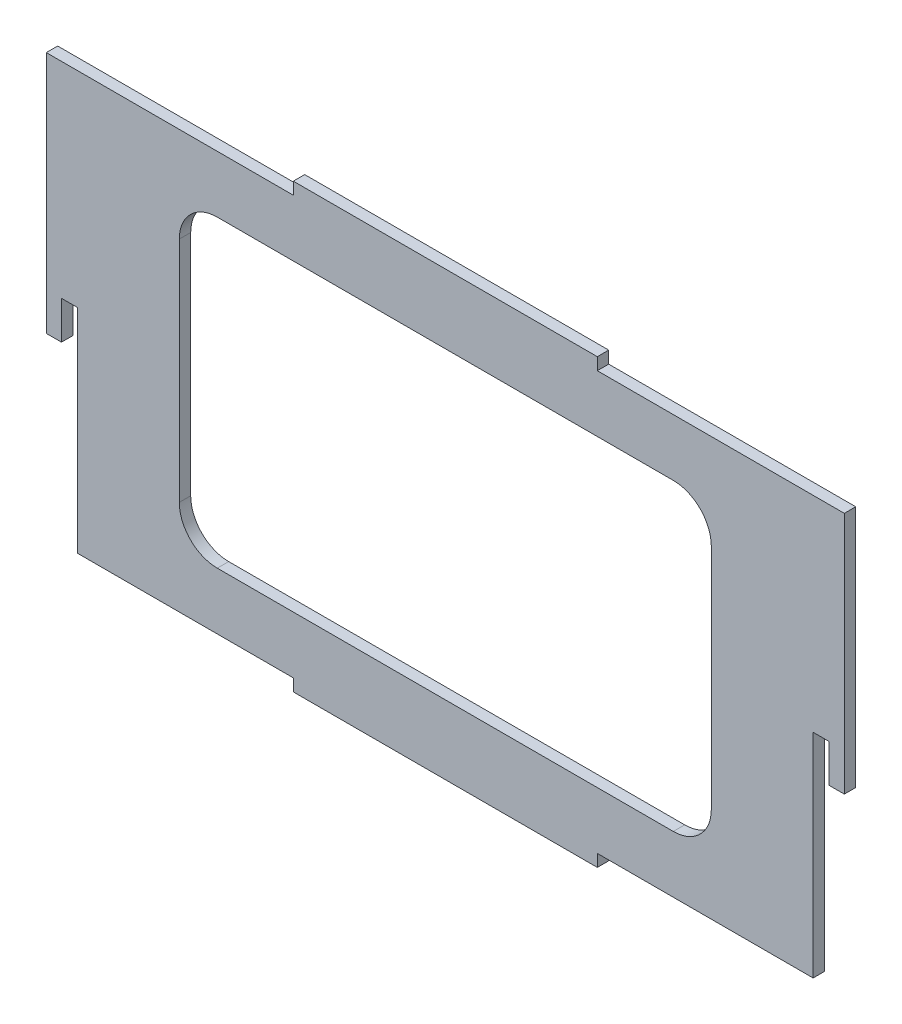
ISO-10303-21;
HEADER;
FILE_DESCRIPTION(('STEP AP214'),'2;1');
FILE_NAME('part.step','',(''),(''),'','','');
FILE_SCHEMA(('AUTOMOTIVE_DESIGN { 1 0 10303 214 1 1 1 1 }'));
ENDSEC;
DATA;
#1=APPLICATION_CONTEXT('core data for automotive mechanical design processes');
#2=APPLICATION_PROTOCOL_DEFINITION('international standard','automotive_design',2000,#1);
#3=PRODUCT_CONTEXT('',#1,'mechanical');
#4=PRODUCT('Part','Part','',(#3));
#5=PRODUCT_RELATED_PRODUCT_CATEGORY('part','',(#4));
#6=PRODUCT_DEFINITION_FORMATION('','',#4);
#7=PRODUCT_DEFINITION_CONTEXT('part definition',#1,'design');
#8=PRODUCT_DEFINITION('design','',#6,#7);
#9=PRODUCT_DEFINITION_SHAPE('','',#8);
#10=(LENGTH_UNIT() NAMED_UNIT(*) SI_UNIT(.MILLI.,.METRE.));
#11=(NAMED_UNIT(*) PLANE_ANGLE_UNIT() SI_UNIT($,.RADIAN.));
#12=(NAMED_UNIT(*) SI_UNIT($,.STERADIAN.) SOLID_ANGLE_UNIT());
#13=UNCERTAINTY_MEASURE_WITH_UNIT(LENGTH_MEASURE(1.E-05),#10,'distance_accuracy_value','');
#14=(GEOMETRIC_REPRESENTATION_CONTEXT(3) GLOBAL_UNCERTAINTY_ASSIGNED_CONTEXT((#13)) GLOBAL_UNIT_ASSIGNED_CONTEXT((#10,
#11,#12)) REPRESENTATION_CONTEXT('',''));
#15=CARTESIAN_POINT('',(0.,0.,0.));
#16=DIRECTION('',(0.,0.,1.));
#17=DIRECTION('',(1.,0.,0.));
#18=AXIS2_PLACEMENT_3D('',#15,#16,#17);
#19=CARTESIAN_POINT('',(0.,0.,1.5));
#20=DIRECTION('',(0.,0.,1.));
#21=DIRECTION('',(1.,0.,0.));
#22=AXIS2_PLACEMENT_3D('',#19,#20,#21);
#23=PLANE('',#22);
#24=DIRECTION('',(1.,0.,0.));
#25=VECTOR('',#24,1.);
#26=CARTESIAN_POINT('',(-30.,-20.,1.5));
#27=LINE('',#26,#25);
#28=CARTESIAN_POINT('',(-30.,-20.,1.5));
#29=VERTEX_POINT('',#28);
#30=CARTESIAN_POINT('',(30.,-20.,1.5));
#31=VERTEX_POINT('',#30);
#32=EDGE_CURVE('E464',#29,#31,#27,.T.);
#33=ORIENTED_EDGE('',*,*,#32,.F.);
#34=CARTESIAN_POINT('',(-30.,-15.,1.5));
#35=DIRECTION('',(0.,0.,1.));
#36=DIRECTION('',(1.,0.,0.));
#37=AXIS2_PLACEMENT_3D('',#34,#35,#36);
#38=CIRCLE('',#37,5.);
#39=CARTESIAN_POINT('',(-35.,-15.,1.5));
#40=VERTEX_POINT('',#39);
#41=EDGE_CURVE('E461',#40,#29,#38,.T.);
#42=ORIENTED_EDGE('',*,*,#41,.F.);
#43=DIRECTION('',(0.,-1.,0.));
#44=VECTOR('',#43,1.);
#45=CARTESIAN_POINT('',(-35.,15.,1.5));
#46=LINE('',#45,#44);
#47=CARTESIAN_POINT('',(-35.,15.,1.5));
#48=VERTEX_POINT('',#47);
#49=EDGE_CURVE('E484',#48,#40,#46,.T.);
#50=ORIENTED_EDGE('',*,*,#49,.F.);
#51=CARTESIAN_POINT('',(-30.,15.,1.5));
#52=DIRECTION('',(0.,0.,1.));
#53=DIRECTION('',(1.,0.,0.));
#54=AXIS2_PLACEMENT_3D('',#51,#52,#53);
#55=CIRCLE('',#54,5.);
#56=CARTESIAN_POINT('',(-30.,20.,1.5));
#57=VERTEX_POINT('',#56);
#58=EDGE_CURVE('E480',#57,#48,#55,.T.);
#59=ORIENTED_EDGE('',*,*,#58,.F.);
#60=DIRECTION('',(-1.,0.,0.));
#61=VECTOR('',#60,1.);
#62=CARTESIAN_POINT('',(-30.,20.,1.5));
#63=LINE('',#62,#61);
#64=CARTESIAN_POINT('',(30.,20.,1.5));
#65=VERTEX_POINT('',#64);
#66=EDGE_CURVE('E477',#65,#57,#63,.T.);
#67=ORIENTED_EDGE('',*,*,#66,.F.);
#68=CARTESIAN_POINT('',(30.,15.,1.5));
#69=DIRECTION('',(0.,0.,1.));
#70=DIRECTION('',(-1.,0.,0.));
#71=AXIS2_PLACEMENT_3D('',#68,#69,#70);
#72=CIRCLE('',#71,5.);
#73=CARTESIAN_POINT('',(35.,15.,1.5));
#74=VERTEX_POINT('',#73);
#75=EDGE_CURVE('E474',#74,#65,#72,.T.);
#76=ORIENTED_EDGE('',*,*,#75,.F.);
#77=DIRECTION('',(0.,1.,0.));
#78=VECTOR('',#77,1.);
#79=CARTESIAN_POINT('',(35.,15.,1.5));
#80=LINE('',#79,#78);
#81=CARTESIAN_POINT('',(35.,-15.,1.5));
#82=VERTEX_POINT('',#81);
#83=EDGE_CURVE('E471',#82,#74,#80,.T.);
#84=ORIENTED_EDGE('',*,*,#83,.F.);
#85=CARTESIAN_POINT('',(30.,-15.,1.5));
#86=DIRECTION('',(0.,0.,1.));
#87=DIRECTION('',(1.,0.,0.));
#88=AXIS2_PLACEMENT_3D('',#85,#86,#87);
#89=CIRCLE('',#88,5.);
#90=EDGE_CURVE('E468',#31,#82,#89,.T.);
#91=ORIENTED_EDGE('',*,*,#90,.F.);
#92=EDGE_LOOP('',(#33,#42,#50,#59,#67,#76,#84,#91));
#93=FACE_BOUND('',#92,.T.);
#94=DIRECTION('',(0.,-1.,0.));
#95=VECTOR('',#94,1.);
#96=CARTESIAN_POINT('',(-52.5,27.5,1.5));
#97=LINE('',#96,#95);
#98=CARTESIAN_POINT('',(-52.5,27.5,1.5));
#99=VERTEX_POINT('',#98);
#100=CARTESIAN_POINT('',(-52.5,-4.5,1.5));
#101=VERTEX_POINT('',#100);
#102=EDGE_CURVE('E409',#99,#101,#97,.T.);
#103=ORIENTED_EDGE('',*,*,#102,.T.);
#104=DIRECTION('',(1.,0.,0.));
#105=VECTOR('',#104,1.);
#106=CARTESIAN_POINT('',(0.,-4.5,1.5));
#107=LINE('',#106,#105);
#108=CARTESIAN_POINT('',(-50.5,-4.5,1.5));
#109=VERTEX_POINT('',#108);
#110=EDGE_CURVE('E224',#101,#109,#107,.T.);
#111=ORIENTED_EDGE('',*,*,#110,.T.);
#112=DIRECTION('',(0.,1.,0.));
#113=VECTOR('',#112,1.);
#114=CARTESIAN_POINT('',(-50.5,-27.5,1.5));
#115=LINE('',#114,#113);
#116=CARTESIAN_POINT('',(-50.5,0.499999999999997,1.5));
#117=VERTEX_POINT('',#116);
#118=EDGE_CURVE('E412',#109,#117,#115,.T.);
#119=ORIENTED_EDGE('',*,*,#118,.T.);
#120=DIRECTION('',(1.,0.,0.));
#121=VECTOR('',#120,1.);
#122=CARTESIAN_POINT('',(-50.5,0.499999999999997,1.5));
#123=LINE('',#122,#121);
#124=CARTESIAN_POINT('',(-48.4,0.499999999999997,1.5));
#125=VERTEX_POINT('',#124);
#126=EDGE_CURVE('E419',#117,#125,#123,.T.);
#127=ORIENTED_EDGE('',*,*,#126,.T.);
#128=DIRECTION('',(0.,-1.,0.));
#129=VECTOR('',#128,1.);
#130=CARTESIAN_POINT('',(-48.4,-27.5,1.5));
#131=LINE('',#130,#129);
#132=CARTESIAN_POINT('',(-48.4,-27.5,1.5));
#133=VERTEX_POINT('',#132);
#134=EDGE_CURVE('E422',#125,#133,#131,.T.);
#135=ORIENTED_EDGE('',*,*,#134,.T.);
#136=DIRECTION('',(1.,0.,0.));
#137=VECTOR('',#136,1.);
#138=CARTESIAN_POINT('',(-48.4,-27.5,1.5));
#139=LINE('',#138,#137);
#140=CARTESIAN_POINT('',(-20.,-27.5,1.5));
#141=VERTEX_POINT('',#140);
#142=EDGE_CURVE('E425',#133,#141,#139,.T.);
#143=ORIENTED_EDGE('',*,*,#142,.T.);
#144=DIRECTION('',(0.,-1.,0.));
#145=VECTOR('',#144,1.);
#146=CARTESIAN_POINT('',(-20.,-27.5,1.5));
#147=LINE('',#146,#145);
#148=CARTESIAN_POINT('',(-20.,-29.1,1.5));
#149=VERTEX_POINT('',#148);
#150=EDGE_CURVE('E428',#141,#149,#147,.T.);
#151=ORIENTED_EDGE('',*,*,#150,.T.);
#152=DIRECTION('',(1.,0.,0.));
#153=VECTOR('',#152,1.);
#154=CARTESIAN_POINT('',(-20.,-29.1,1.5));
#155=LINE('',#154,#153);
#156=CARTESIAN_POINT('',(20.,-29.1,1.5));
#157=VERTEX_POINT('',#156);
#158=EDGE_CURVE('E431',#149,#157,#155,.T.);
#159=ORIENTED_EDGE('',*,*,#158,.T.);
#160=DIRECTION('',(0.,1.,0.));
#161=VECTOR('',#160,1.);
#162=CARTESIAN_POINT('',(20.,-27.5,1.5));
#163=LINE('',#162,#161);
#164=CARTESIAN_POINT('',(20.,-27.5,1.5));
#165=VERTEX_POINT('',#164);
#166=EDGE_CURVE('E434',#157,#165,#163,.T.);
#167=ORIENTED_EDGE('',*,*,#166,.T.);
#168=DIRECTION('',(1.,0.,0.));
#169=VECTOR('',#168,1.);
#170=CARTESIAN_POINT('',(20.,-27.5,1.5));
#171=LINE('',#170,#169);
#172=CARTESIAN_POINT('',(48.4,-27.5,1.5));
#173=VERTEX_POINT('',#172);
#174=EDGE_CURVE('E437',#165,#173,#171,.T.);
#175=ORIENTED_EDGE('',*,*,#174,.T.);
#176=DIRECTION('',(0.,1.,0.));
#177=VECTOR('',#176,1.);
#178=CARTESIAN_POINT('',(48.4,-27.5,1.5));
#179=LINE('',#178,#177);
#180=CARTESIAN_POINT('',(48.4,0.499999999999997,1.5));
#181=VERTEX_POINT('',#180);
#182=EDGE_CURVE('E440',#173,#181,#179,.T.);
#183=ORIENTED_EDGE('',*,*,#182,.T.);
#184=DIRECTION('',(1.,0.,0.));
#185=VECTOR('',#184,1.);
#186=CARTESIAN_POINT('',(50.5,0.499999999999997,1.5));
#187=LINE('',#186,#185);
#188=CARTESIAN_POINT('',(50.5,0.499999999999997,1.5));
#189=VERTEX_POINT('',#188);
#190=EDGE_CURVE('E389',#181,#189,#187,.T.);
#191=ORIENTED_EDGE('',*,*,#190,.T.);
#192=DIRECTION('',(0.,-1.,0.));
#193=VECTOR('',#192,1.);
#194=CARTESIAN_POINT('',(50.5,-27.5,1.5));
#195=LINE('',#194,#193);
#196=CARTESIAN_POINT('',(50.5,-4.5,1.5));
#197=VERTEX_POINT('',#196);
#198=EDGE_CURVE('E377',#189,#197,#195,.T.);
#199=ORIENTED_EDGE('',*,*,#198,.T.);
#200=DIRECTION('',(1.,0.,0.));
#201=VECTOR('',#200,1.);
#202=CARTESIAN_POINT('',(0.,-4.5,1.5));
#203=LINE('',#202,#201);
#204=CARTESIAN_POINT('',(52.5,-4.5,1.5));
#205=VERTEX_POINT('',#204);
#206=EDGE_CURVE('E229',#197,#205,#203,.T.);
#207=ORIENTED_EDGE('',*,*,#206,.T.);
#208=DIRECTION('',(0.,1.,0.));
#209=VECTOR('',#208,1.);
#210=CARTESIAN_POINT('',(52.5,27.5,1.5));
#211=LINE('',#210,#209);
#212=CARTESIAN_POINT('',(52.5,27.5,1.5));
#213=VERTEX_POINT('',#212);
#214=EDGE_CURVE('E374',#205,#213,#211,.T.);
#215=ORIENTED_EDGE('',*,*,#214,.T.);
#216=DIRECTION('',(-1.,0.,0.));
#217=VECTOR('',#216,1.);
#218=CARTESIAN_POINT('',(20.,27.5,1.5));
#219=LINE('',#218,#217);
#220=CARTESIAN_POINT('',(20.,27.5,1.5));
#221=VERTEX_POINT('',#220);
#222=EDGE_CURVE('E383',#213,#221,#219,.T.);
#223=ORIENTED_EDGE('',*,*,#222,.T.);
#224=DIRECTION('',(0.,1.,0.));
#225=VECTOR('',#224,1.);
#226=CARTESIAN_POINT('',(20.,27.5,1.5));
#227=LINE('',#226,#225);
#228=CARTESIAN_POINT('',(20.,29.1,1.5));
#229=VERTEX_POINT('',#228);
#230=EDGE_CURVE('E387',#221,#229,#227,.T.);
#231=ORIENTED_EDGE('',*,*,#230,.T.);
#232=DIRECTION('',(-1.,0.,0.));
#233=VECTOR('',#232,1.);
#234=CARTESIAN_POINT('',(-20.,29.1,1.5));
#235=LINE('',#234,#233);
#236=CARTESIAN_POINT('',(-20.,29.1,1.5));
#237=VERTEX_POINT('',#236);
#238=EDGE_CURVE('E395',#229,#237,#235,.T.);
#239=ORIENTED_EDGE('',*,*,#238,.T.);
#240=DIRECTION('',(0.,-1.,0.));
#241=VECTOR('',#240,1.);
#242=CARTESIAN_POINT('',(-20.,27.5,1.5));
#243=LINE('',#242,#241);
#244=CARTESIAN_POINT('',(-20.,27.5,1.5));
#245=VERTEX_POINT('',#244);
#246=EDGE_CURVE('E308',#237,#245,#243,.T.);
#247=ORIENTED_EDGE('',*,*,#246,.T.);
#248=DIRECTION('',(-1.,0.,0.));
#249=VECTOR('',#248,1.);
#250=CARTESIAN_POINT('',(-52.5,27.5,1.5));
#251=LINE('',#250,#249);
#252=EDGE_CURVE('E302',#245,#99,#251,.T.);
#253=ORIENTED_EDGE('',*,*,#252,.T.);
#254=EDGE_LOOP('',(#103,#111,#119,#127,#135,#143,#151,#159,#167,#175,#183,#191,#199,#207,#215,
#223,#231,#239,#247,#253));
#255=FACE_BOUND('',#254,.T.);
#256=ADVANCED_FACE('F38',(#93,#255),#23,.T.);
#257=CARTESIAN_POINT('',(0.,0.,0.));
#258=DIRECTION('',(0.,0.,1.));
#259=DIRECTION('',(1.,0.,0.));
#260=AXIS2_PLACEMENT_3D('',#257,#258,#259);
#261=PLANE('',#260);
#262=CARTESIAN_POINT('',(-30.,-15.,0.));
#263=DIRECTION('',(0.,0.,1.));
#264=DIRECTION('',(1.,0.,0.));
#265=AXIS2_PLACEMENT_3D('',#262,#263,#264);
#266=CIRCLE('',#265,5.);
#267=CARTESIAN_POINT('',(-35.,-15.,0.));
#268=VERTEX_POINT('',#267);
#269=CARTESIAN_POINT('',(-30.,-20.,0.));
#270=VERTEX_POINT('',#269);
#271=EDGE_CURVE('E460',#268,#270,#266,.T.);
#272=ORIENTED_EDGE('',*,*,#271,.T.);
#273=DIRECTION('',(1.,0.,0.));
#274=VECTOR('',#273,1.);
#275=CARTESIAN_POINT('',(-30.,-20.,0.));
#276=LINE('',#275,#274);
#277=CARTESIAN_POINT('',(30.,-20.,0.));
#278=VERTEX_POINT('',#277);
#279=EDGE_CURVE('E491',#270,#278,#276,.T.);
#280=ORIENTED_EDGE('',*,*,#279,.T.);
#281=CARTESIAN_POINT('',(30.,-15.,0.));
#282=DIRECTION('',(0.,0.,1.));
#283=DIRECTION('',(1.,0.,0.));
#284=AXIS2_PLACEMENT_3D('',#281,#282,#283);
#285=CIRCLE('',#284,5.);
#286=CARTESIAN_POINT('',(35.,-15.,0.));
#287=VERTEX_POINT('',#286);
#288=EDGE_CURVE('E495',#278,#287,#285,.T.);
#289=ORIENTED_EDGE('',*,*,#288,.T.);
#290=DIRECTION('',(0.,1.,0.));
#291=VECTOR('',#290,1.);
#292=CARTESIAN_POINT('',(35.,15.,0.));
#293=LINE('',#292,#291);
#294=CARTESIAN_POINT('',(35.,15.,0.));
#295=VERTEX_POINT('',#294);
#296=EDGE_CURVE('E499',#287,#295,#293,.T.);
#297=ORIENTED_EDGE('',*,*,#296,.T.);
#298=CARTESIAN_POINT('',(30.,15.,0.));
#299=DIRECTION('',(0.,0.,1.));
#300=DIRECTION('',(-1.,0.,0.));
#301=AXIS2_PLACEMENT_3D('',#298,#299,#300);
#302=CIRCLE('',#301,5.);
#303=CARTESIAN_POINT('',(30.,20.,0.));
#304=VERTEX_POINT('',#303);
#305=EDGE_CURVE('E503',#295,#304,#302,.T.);
#306=ORIENTED_EDGE('',*,*,#305,.T.);
#307=DIRECTION('',(-1.,0.,0.));
#308=VECTOR('',#307,1.);
#309=CARTESIAN_POINT('',(-30.,20.,0.));
#310=LINE('',#309,#308);
#311=CARTESIAN_POINT('',(-30.,20.,0.));
#312=VERTEX_POINT('',#311);
#313=EDGE_CURVE('E507',#304,#312,#310,.T.);
#314=ORIENTED_EDGE('',*,*,#313,.T.);
#315=CARTESIAN_POINT('',(-30.,15.,0.));
#316=DIRECTION('',(0.,0.,1.));
#317=DIRECTION('',(1.,0.,0.));
#318=AXIS2_PLACEMENT_3D('',#315,#316,#317);
#319=CIRCLE('',#318,5.);
#320=CARTESIAN_POINT('',(-35.,15.,0.));
#321=VERTEX_POINT('',#320);
#322=EDGE_CURVE('E511',#312,#321,#319,.T.);
#323=ORIENTED_EDGE('',*,*,#322,.T.);
#324=DIRECTION('',(0.,-1.,0.));
#325=VECTOR('',#324,1.);
#326=CARTESIAN_POINT('',(-35.,15.,0.));
#327=LINE('',#326,#325);
#328=EDGE_CURVE('E465',#321,#268,#327,.T.);
#329=ORIENTED_EDGE('',*,*,#328,.T.);
#330=EDGE_LOOP('',(#272,#280,#289,#297,#306,#314,#323,#329));
#331=FACE_BOUND('',#330,.T.);
#332=DIRECTION('',(-1.,0.,0.));
#333=VECTOR('',#332,1.);
#334=CARTESIAN_POINT('',(-52.5,-4.5,0.));
#335=LINE('',#334,#333);
#336=CARTESIAN_POINT('',(-50.5,-4.5,0.));
#337=VERTEX_POINT('',#336);
#338=CARTESIAN_POINT('',(-52.5,-4.5,0.));
#339=VERTEX_POINT('',#338);
#340=EDGE_CURVE('E53',#337,#339,#335,.T.);
#341=ORIENTED_EDGE('',*,*,#340,.T.);
#342=DIRECTION('',(0.,-1.,0.));
#343=VECTOR('',#342,1.);
#344=CARTESIAN_POINT('',(-52.5,27.5,0.));
#345=LINE('',#344,#343);
#346=CARTESIAN_POINT('',(-52.5,27.5,0.));
#347=VERTEX_POINT('',#346);
#348=EDGE_CURVE('E235',#347,#339,#345,.T.);
#349=ORIENTED_EDGE('',*,*,#348,.F.);
#350=DIRECTION('',(-1.,0.,0.));
#351=VECTOR('',#350,1.);
#352=CARTESIAN_POINT('',(-52.5,27.5,0.));
#353=LINE('',#352,#351);
#354=CARTESIAN_POINT('',(-20.,27.5,0.));
#355=VERTEX_POINT('',#354);
#356=EDGE_CURVE('E247',#355,#347,#353,.T.);
#357=ORIENTED_EDGE('',*,*,#356,.F.);
#358=DIRECTION('',(0.,-1.,0.));
#359=VECTOR('',#358,1.);
#360=CARTESIAN_POINT('',(-20.,27.5,0.));
#361=LINE('',#360,#359);
#362=CARTESIAN_POINT('',(-20.,29.1,0.));
#363=VERTEX_POINT('',#362);
#364=EDGE_CURVE('E299',#363,#355,#361,.T.);
#365=ORIENTED_EDGE('',*,*,#364,.F.);
#366=DIRECTION('',(-1.,0.,0.));
#367=VECTOR('',#366,1.);
#368=CARTESIAN_POINT('',(-20.,29.1,0.));
#369=LINE('',#368,#367);
#370=CARTESIAN_POINT('',(20.,29.1,0.));
#371=VERTEX_POINT('',#370);
#372=EDGE_CURVE('E296',#371,#363,#369,.T.);
#373=ORIENTED_EDGE('',*,*,#372,.F.);
#374=DIRECTION('',(0.,1.,0.));
#375=VECTOR('',#374,1.);
#376=CARTESIAN_POINT('',(20.,27.5,0.));
#377=LINE('',#376,#375);
#378=CARTESIAN_POINT('',(20.,27.5,0.));
#379=VERTEX_POINT('',#378);
#380=EDGE_CURVE('E293',#379,#371,#377,.T.);
#381=ORIENTED_EDGE('',*,*,#380,.F.);
#382=DIRECTION('',(-1.,0.,0.));
#383=VECTOR('',#382,1.);
#384=CARTESIAN_POINT('',(20.,27.5,0.));
#385=LINE('',#384,#383);
#386=CARTESIAN_POINT('',(52.5,27.5,0.));
#387=VERTEX_POINT('',#386);
#388=EDGE_CURVE('E290',#387,#379,#385,.T.);
#389=ORIENTED_EDGE('',*,*,#388,.F.);
#390=DIRECTION('',(0.,1.,0.));
#391=VECTOR('',#390,1.);
#392=CARTESIAN_POINT('',(52.5,27.5,0.));
#393=LINE('',#392,#391);
#394=CARTESIAN_POINT('',(52.5,-4.5,0.));
#395=VERTEX_POINT('',#394);
#396=EDGE_CURVE('E287',#395,#387,#393,.T.);
#397=ORIENTED_EDGE('',*,*,#396,.F.);
#398=DIRECTION('',(-1.,0.,0.));
#399=VECTOR('',#398,1.);
#400=CARTESIAN_POINT('',(52.5,-4.5,0.));
#401=LINE('',#400,#399);
#402=CARTESIAN_POINT('',(50.5,-4.5,0.));
#403=VERTEX_POINT('',#402);
#404=EDGE_CURVE('E61',#395,#403,#401,.T.);
#405=ORIENTED_EDGE('',*,*,#404,.T.);
#406=DIRECTION('',(0.,-1.,0.));
#407=VECTOR('',#406,1.);
#408=CARTESIAN_POINT('',(50.5,-27.5,0.));
#409=LINE('',#408,#407);
#410=CARTESIAN_POINT('',(50.5,0.499999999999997,0.));
#411=VERTEX_POINT('',#410);
#412=EDGE_CURVE('E283',#411,#403,#409,.T.);
#413=ORIENTED_EDGE('',*,*,#412,.F.);
#414=DIRECTION('',(1.,0.,0.));
#415=VECTOR('',#414,1.);
#416=CARTESIAN_POINT('',(50.5,0.499999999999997,0.));
#417=LINE('',#416,#415);
#418=CARTESIAN_POINT('',(48.4,0.499999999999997,0.));
#419=VERTEX_POINT('',#418);
#420=EDGE_CURVE('E280',#419,#411,#417,.T.);
#421=ORIENTED_EDGE('',*,*,#420,.F.);
#422=DIRECTION('',(0.,1.,0.));
#423=VECTOR('',#422,1.);
#424=CARTESIAN_POINT('',(48.4,-27.5,0.));
#425=LINE('',#424,#423);
#426=CARTESIAN_POINT('',(48.4,-27.5,0.));
#427=VERTEX_POINT('',#426);
#428=EDGE_CURVE('E277',#427,#419,#425,.T.);
#429=ORIENTED_EDGE('',*,*,#428,.F.);
#430=DIRECTION('',(1.,0.,0.));
#431=VECTOR('',#430,1.);
#432=CARTESIAN_POINT('',(20.,-27.5,0.));
#433=LINE('',#432,#431);
#434=CARTESIAN_POINT('',(20.,-27.5,0.));
#435=VERTEX_POINT('',#434);
#436=EDGE_CURVE('E274',#435,#427,#433,.T.);
#437=ORIENTED_EDGE('',*,*,#436,.F.);
#438=DIRECTION('',(0.,1.,0.));
#439=VECTOR('',#438,1.);
#440=CARTESIAN_POINT('',(20.,-27.5,0.));
#441=LINE('',#440,#439);
#442=CARTESIAN_POINT('',(20.,-29.1,0.));
#443=VERTEX_POINT('',#442);
#444=EDGE_CURVE('E271',#443,#435,#441,.T.);
#445=ORIENTED_EDGE('',*,*,#444,.F.);
#446=DIRECTION('',(1.,0.,0.));
#447=VECTOR('',#446,1.);
#448=CARTESIAN_POINT('',(-20.,-29.1,0.));
#449=LINE('',#448,#447);
#450=CARTESIAN_POINT('',(-20.,-29.1,0.));
#451=VERTEX_POINT('',#450);
#452=EDGE_CURVE('E268',#451,#443,#449,.T.);
#453=ORIENTED_EDGE('',*,*,#452,.F.);
#454=DIRECTION('',(0.,-1.,0.));
#455=VECTOR('',#454,1.);
#456=CARTESIAN_POINT('',(-20.,-27.5,0.));
#457=LINE('',#456,#455);
#458=CARTESIAN_POINT('',(-20.,-27.5,0.));
#459=VERTEX_POINT('',#458);
#460=EDGE_CURVE('E265',#459,#451,#457,.T.);
#461=ORIENTED_EDGE('',*,*,#460,.F.);
#462=DIRECTION('',(1.,0.,0.));
#463=VECTOR('',#462,1.);
#464=CARTESIAN_POINT('',(-48.4,-27.5,0.));
#465=LINE('',#464,#463);
#466=CARTESIAN_POINT('',(-48.4,-27.5,0.));
#467=VERTEX_POINT('',#466);
#468=EDGE_CURVE('E262',#467,#459,#465,.T.);
#469=ORIENTED_EDGE('',*,*,#468,.F.);
#470=DIRECTION('',(0.,-1.,0.));
#471=VECTOR('',#470,1.);
#472=CARTESIAN_POINT('',(-48.4,-27.5,0.));
#473=LINE('',#472,#471);
#474=CARTESIAN_POINT('',(-48.4,0.499999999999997,0.));
#475=VERTEX_POINT('',#474);
#476=EDGE_CURVE('E259',#475,#467,#473,.T.);
#477=ORIENTED_EDGE('',*,*,#476,.F.);
#478=DIRECTION('',(1.,0.,0.));
#479=VECTOR('',#478,1.);
#480=CARTESIAN_POINT('',(-50.5,0.499999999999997,0.));
#481=LINE('',#480,#479);
#482=CARTESIAN_POINT('',(-50.5,0.499999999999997,0.));
#483=VERTEX_POINT('',#482);
#484=EDGE_CURVE('E251',#483,#475,#481,.T.);
#485=ORIENTED_EDGE('',*,*,#484,.F.);
#486=DIRECTION('',(0.,1.,0.));
#487=VECTOR('',#486,1.);
#488=CARTESIAN_POINT('',(-50.5,-27.5,0.));
#489=LINE('',#488,#487);
#490=EDGE_CURVE('E238',#337,#483,#489,.T.);
#491=ORIENTED_EDGE('',*,*,#490,.F.);
#492=EDGE_LOOP('',(#341,#349,#357,#365,#373,#381,#389,#397,#405,#413,#421,#429,#437,#445,#453,
#461,#469,#477,#485,#491));
#493=FACE_BOUND('',#492,.T.);
#494=ADVANCED_FACE('F233',(#331,#493),#261,.F.);
#495=CARTESIAN_POINT('',(-52.5,27.5,1.5));
#496=DIRECTION('',(1.,0.,0.));
#497=DIRECTION('',(0.,0.,-1.));
#498=AXIS2_PLACEMENT_3D('',#495,#496,#497);
#499=PLANE('',#498);
#500=DIRECTION('',(0.,0.,-1.));
#501=VECTOR('',#500,1.);
#502=CARTESIAN_POINT('',(-52.5,-4.5,10.));
#503=LINE('',#502,#501);
#504=EDGE_CURVE('E221',#101,#339,#503,.T.);
#505=ORIENTED_EDGE('',*,*,#504,.F.);
#506=ORIENTED_EDGE('',*,*,#102,.F.);
#507=DIRECTION('',(0.,0.,-1.));
#508=VECTOR('',#507,1.);
#509=CARTESIAN_POINT('',(-52.5,27.5,1.5));
#510=LINE('',#509,#508);
#511=EDGE_CURVE('E244',#99,#347,#510,.T.);
#512=ORIENTED_EDGE('',*,*,#511,.T.);
#513=ORIENTED_EDGE('',*,*,#348,.T.);
#514=EDGE_LOOP('',(#505,#506,#512,#513));
#515=FACE_BOUND('',#514,.T.);
#516=ADVANCED_FACE('F242',(#515),#499,.F.);
#517=CARTESIAN_POINT('',(-50.5,-27.5,1.5));
#518=DIRECTION('',(-1.,0.,0.));
#519=DIRECTION('',(0.,-1.,0.));
#520=AXIS2_PLACEMENT_3D('',#517,#518,#519);
#521=PLANE('',#520);
#522=DIRECTION('',(0.,0.,1.));
#523=VECTOR('',#522,1.);
#524=CARTESIAN_POINT('',(-50.5,-4.5,1.5));
#525=LINE('',#524,#523);
#526=EDGE_CURVE('E11',#337,#109,#525,.T.);
#527=ORIENTED_EDGE('',*,*,#526,.F.);
#528=ORIENTED_EDGE('',*,*,#490,.T.);
#529=DIRECTION('',(0.,0.,-1.));
#530=VECTOR('',#529,1.);
#531=CARTESIAN_POINT('',(-50.5,0.499999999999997,1.5));
#532=LINE('',#531,#530);
#533=EDGE_CURVE('E360',#117,#483,#532,.T.);
#534=ORIENTED_EDGE('',*,*,#533,.F.);
#535=ORIENTED_EDGE('',*,*,#118,.F.);
#536=EDGE_LOOP('',(#527,#528,#534,#535));
#537=FACE_BOUND('',#536,.T.);
#538=ADVANCED_FACE('F614',(#537),#521,.F.);
#539=CARTESIAN_POINT('',(50.5,-27.5,1.5));
#540=DIRECTION('',(1.,0.,0.));
#541=DIRECTION('',(0.,1.,0.));
#542=AXIS2_PLACEMENT_3D('',#539,#540,#541);
#543=PLANE('',#542);
#544=DIRECTION('',(0.,0.,-1.));
#545=VECTOR('',#544,1.);
#546=CARTESIAN_POINT('',(50.5,-4.5,10.));
#547=LINE('',#546,#545);
#548=EDGE_CURVE('E240',#197,#403,#547,.T.);
#549=ORIENTED_EDGE('',*,*,#548,.F.);
#550=ORIENTED_EDGE('',*,*,#198,.F.);
#551=DIRECTION('',(0.,0.,-1.));
#552=VECTOR('',#551,1.);
#553=CARTESIAN_POINT('',(50.5,0.499999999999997,1.5));
#554=LINE('',#553,#552);
#555=EDGE_CURVE('E324',#189,#411,#554,.T.);
#556=ORIENTED_EDGE('',*,*,#555,.T.);
#557=ORIENTED_EDGE('',*,*,#412,.T.);
#558=EDGE_LOOP('',(#549,#550,#556,#557));
#559=FACE_BOUND('',#558,.T.);
#560=ADVANCED_FACE('F452',(#559),#543,.F.);
#561=CARTESIAN_POINT('',(52.5,27.5,1.5));
#562=DIRECTION('',(-1.,0.,0.));
#563=DIRECTION('',(0.,-1.,0.));
#564=AXIS2_PLACEMENT_3D('',#561,#562,#563);
#565=PLANE('',#564);
#566=DIRECTION('',(0.,0.,1.));
#567=VECTOR('',#566,1.);
#568=CARTESIAN_POINT('',(52.5,-4.5,1.5));
#569=LINE('',#568,#567);
#570=EDGE_CURVE('E47',#395,#205,#569,.T.);
#571=ORIENTED_EDGE('',*,*,#570,.F.);
#572=ORIENTED_EDGE('',*,*,#396,.T.);
#573=DIRECTION('',(0.,0.,-1.));
#574=VECTOR('',#573,1.);
#575=CARTESIAN_POINT('',(52.5,27.5,1.5));
#576=LINE('',#575,#574);
#577=EDGE_CURVE('E320',#213,#387,#576,.T.);
#578=ORIENTED_EDGE('',*,*,#577,.F.);
#579=ORIENTED_EDGE('',*,*,#214,.F.);
#580=EDGE_LOOP('',(#571,#572,#578,#579));
#581=FACE_BOUND('',#580,.T.);
#582=ADVANCED_FACE('F380',(#581),#565,.F.);
#583=CARTESIAN_POINT('',(-52.5,27.5,1.5));
#584=DIRECTION('',(0.,-1.,0.));
#585=DIRECTION('',(1.,0.,0.));
#586=AXIS2_PLACEMENT_3D('',#583,#584,#585);
#587=PLANE('',#586);
#588=ORIENTED_EDGE('',*,*,#356,.T.);
#589=ORIENTED_EDGE('',*,*,#511,.F.);
#590=ORIENTED_EDGE('',*,*,#252,.F.);
#591=DIRECTION('',(0.,0.,-1.));
#592=VECTOR('',#591,1.);
#593=CARTESIAN_POINT('',(-20.,27.5,1.5));
#594=LINE('',#593,#592);
#595=EDGE_CURVE('E303',#245,#355,#594,.T.);
#596=ORIENTED_EDGE('',*,*,#595,.T.);
#597=EDGE_LOOP('',(#588,#589,#590,#596));
#598=FACE_BOUND('',#597,.T.);
#599=ADVANCED_FACE('F40',(#598),#587,.F.);
#600=CARTESIAN_POINT('',(-50.5,0.499999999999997,1.5));
#601=DIRECTION('',(0.,1.,0.));
#602=DIRECTION('',(0.,0.,1.));
#603=AXIS2_PLACEMENT_3D('',#600,#601,#602);
#604=PLANE('',#603);
#605=ORIENTED_EDGE('',*,*,#484,.T.);
#606=DIRECTION('',(0.,0.,-1.));
#607=VECTOR('',#606,1.);
#608=CARTESIAN_POINT('',(-48.4,0.499999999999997,1.5));
#609=LINE('',#608,#607);
#610=EDGE_CURVE('E356',#125,#475,#609,.T.);
#611=ORIENTED_EDGE('',*,*,#610,.F.);
#612=ORIENTED_EDGE('',*,*,#126,.F.);
#613=ORIENTED_EDGE('',*,*,#533,.T.);
#614=EDGE_LOOP('',(#605,#611,#612,#613));
#615=FACE_BOUND('',#614,.T.);
#616=ADVANCED_FACE('F644',(#615),#604,.F.);
#617=CARTESIAN_POINT('',(-48.4,-27.5,1.5));
#618=DIRECTION('',(1.,0.,0.));
#619=DIRECTION('',(0.,0.,-1.));
#620=AXIS2_PLACEMENT_3D('',#617,#618,#619);
#621=PLANE('',#620);
#622=ORIENTED_EDGE('',*,*,#476,.T.);
#623=DIRECTION('',(0.,0.,-1.));
#624=VECTOR('',#623,1.);
#625=CARTESIAN_POINT('',(-48.4,-27.5,1.5));
#626=LINE('',#625,#624);
#627=EDGE_CURVE('E352',#133,#467,#626,.T.);
#628=ORIENTED_EDGE('',*,*,#627,.F.);
#629=ORIENTED_EDGE('',*,*,#134,.F.);
#630=ORIENTED_EDGE('',*,*,#610,.T.);
#631=EDGE_LOOP('',(#622,#628,#629,#630));
#632=FACE_BOUND('',#631,.T.);
#633=ADVANCED_FACE('F640',(#632),#621,.F.);
#634=CARTESIAN_POINT('',(-48.4,-27.5,1.5));
#635=DIRECTION('',(0.,1.,0.));
#636=DIRECTION('',(-1.,0.,0.));
#637=AXIS2_PLACEMENT_3D('',#634,#635,#636);
#638=PLANE('',#637);
#639=ORIENTED_EDGE('',*,*,#468,.T.);
#640=DIRECTION('',(0.,0.,-1.));
#641=VECTOR('',#640,1.);
#642=CARTESIAN_POINT('',(-20.,-27.5,1.5));
#643=LINE('',#642,#641);
#644=EDGE_CURVE('E348',#141,#459,#643,.T.);
#645=ORIENTED_EDGE('',*,*,#644,.F.);
#646=ORIENTED_EDGE('',*,*,#142,.F.);
#647=ORIENTED_EDGE('',*,*,#627,.T.);
#648=EDGE_LOOP('',(#639,#645,#646,#647));
#649=FACE_BOUND('',#648,.T.);
#650=ADVANCED_FACE('F636',(#649),#638,.F.);
#651=CARTESIAN_POINT('',(-20.,-27.5,1.5));
#652=DIRECTION('',(1.,0.,0.));
#653=DIRECTION('',(0.,0.,-1.));
#654=AXIS2_PLACEMENT_3D('',#651,#652,#653);
#655=PLANE('',#654);
#656=ORIENTED_EDGE('',*,*,#460,.T.);
#657=DIRECTION('',(0.,0.,-1.));
#658=VECTOR('',#657,1.);
#659=CARTESIAN_POINT('',(-20.,-29.1,1.5));
#660=LINE('',#659,#658);
#661=EDGE_CURVE('E344',#149,#451,#660,.T.);
#662=ORIENTED_EDGE('',*,*,#661,.F.);
#663=ORIENTED_EDGE('',*,*,#150,.F.);
#664=ORIENTED_EDGE('',*,*,#644,.T.);
#665=EDGE_LOOP('',(#656,#662,#663,#664));
#666=FACE_BOUND('',#665,.T.);
#667=ADVANCED_FACE('F632',(#666),#655,.F.);
#668=CARTESIAN_POINT('',(-20.,-29.1,1.5));
#669=DIRECTION('',(0.,1.,0.));
#670=DIRECTION('',(-1.,0.,0.));
#671=AXIS2_PLACEMENT_3D('',#668,#669,#670);
#672=PLANE('',#671);
#673=ORIENTED_EDGE('',*,*,#452,.T.);
#674=DIRECTION('',(0.,0.,-1.));
#675=VECTOR('',#674,1.);
#676=CARTESIAN_POINT('',(20.,-29.1,1.5));
#677=LINE('',#676,#675);
#678=EDGE_CURVE('E340',#157,#443,#677,.T.);
#679=ORIENTED_EDGE('',*,*,#678,.F.);
#680=ORIENTED_EDGE('',*,*,#158,.F.);
#681=ORIENTED_EDGE('',*,*,#661,.T.);
#682=EDGE_LOOP('',(#673,#679,#680,#681));
#683=FACE_BOUND('',#682,.T.);
#684=ADVANCED_FACE('F628',(#683),#672,.F.);
#685=CARTESIAN_POINT('',(20.,-27.5,1.5));
#686=DIRECTION('',(-1.,0.,0.));
#687=DIRECTION('',(0.,0.,1.));
#688=AXIS2_PLACEMENT_3D('',#685,#686,#687);
#689=PLANE('',#688);
#690=ORIENTED_EDGE('',*,*,#444,.T.);
#691=DIRECTION('',(0.,0.,-1.));
#692=VECTOR('',#691,1.);
#693=CARTESIAN_POINT('',(20.,-27.5,1.5));
#694=LINE('',#693,#692);
#695=EDGE_CURVE('E336',#165,#435,#694,.T.);
#696=ORIENTED_EDGE('',*,*,#695,.F.);
#697=ORIENTED_EDGE('',*,*,#166,.F.);
#698=ORIENTED_EDGE('',*,*,#678,.T.);
#699=EDGE_LOOP('',(#690,#696,#697,#698));
#700=FACE_BOUND('',#699,.T.);
#701=ADVANCED_FACE('F624',(#700),#689,.F.);
#702=CARTESIAN_POINT('',(20.,-27.5,1.5));
#703=DIRECTION('',(0.,1.,0.));
#704=DIRECTION('',(-1.,0.,0.));
#705=AXIS2_PLACEMENT_3D('',#702,#703,#704);
#706=PLANE('',#705);
#707=ORIENTED_EDGE('',*,*,#436,.T.);
#708=DIRECTION('',(0.,0.,-1.));
#709=VECTOR('',#708,1.);
#710=CARTESIAN_POINT('',(48.4,-27.5,1.5));
#711=LINE('',#710,#709);
#712=EDGE_CURVE('E332',#173,#427,#711,.T.);
#713=ORIENTED_EDGE('',*,*,#712,.F.);
#714=ORIENTED_EDGE('',*,*,#174,.F.);
#715=ORIENTED_EDGE('',*,*,#695,.T.);
#716=EDGE_LOOP('',(#707,#713,#714,#715));
#717=FACE_BOUND('',#716,.T.);
#718=ADVANCED_FACE('F620',(#717),#706,.F.);
#719=CARTESIAN_POINT('',(48.4,-27.5,1.5));
#720=DIRECTION('',(-1.,0.,0.));
#721=DIRECTION('',(0.,0.,1.));
#722=AXIS2_PLACEMENT_3D('',#719,#720,#721);
#723=PLANE('',#722);
#724=ORIENTED_EDGE('',*,*,#428,.T.);
#725=DIRECTION('',(0.,0.,-1.));
#726=VECTOR('',#725,1.);
#727=CARTESIAN_POINT('',(48.4,0.499999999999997,1.5));
#728=LINE('',#727,#726);
#729=EDGE_CURVE('E328',#181,#419,#728,.T.);
#730=ORIENTED_EDGE('',*,*,#729,.F.);
#731=ORIENTED_EDGE('',*,*,#182,.F.);
#732=ORIENTED_EDGE('',*,*,#712,.T.);
#733=EDGE_LOOP('',(#724,#730,#731,#732));
#734=FACE_BOUND('',#733,.T.);
#735=ADVANCED_FACE('F617',(#734),#723,.F.);
#736=CARTESIAN_POINT('',(50.5,0.499999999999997,1.5));
#737=DIRECTION('',(0.,1.,0.));
#738=DIRECTION('',(0.,0.,1.));
#739=AXIS2_PLACEMENT_3D('',#736,#737,#738);
#740=PLANE('',#739);
#741=ORIENTED_EDGE('',*,*,#420,.T.);
#742=ORIENTED_EDGE('',*,*,#555,.F.);
#743=ORIENTED_EDGE('',*,*,#190,.F.);
#744=ORIENTED_EDGE('',*,*,#729,.T.);
#745=EDGE_LOOP('',(#741,#742,#743,#744));
#746=FACE_BOUND('',#745,.T.);
#747=ADVANCED_FACE('F448',(#746),#740,.F.);
#748=CARTESIAN_POINT('',(20.,27.5,1.5));
#749=DIRECTION('',(0.,-1.,0.));
#750=DIRECTION('',(1.,0.,0.));
#751=AXIS2_PLACEMENT_3D('',#748,#749,#750);
#752=PLANE('',#751);
#753=ORIENTED_EDGE('',*,*,#388,.T.);
#754=DIRECTION('',(0.,0.,-1.));
#755=VECTOR('',#754,1.);
#756=CARTESIAN_POINT('',(20.,27.5,1.5));
#757=LINE('',#756,#755);
#758=EDGE_CURVE('E316',#221,#379,#757,.T.);
#759=ORIENTED_EDGE('',*,*,#758,.F.);
#760=ORIENTED_EDGE('',*,*,#222,.F.);
#761=ORIENTED_EDGE('',*,*,#577,.T.);
#762=EDGE_LOOP('',(#753,#759,#760,#761));
#763=FACE_BOUND('',#762,.T.);
#764=ADVANCED_FACE('F605',(#763),#752,.F.);
#765=CARTESIAN_POINT('',(20.,27.5,1.5));
#766=DIRECTION('',(-1.,0.,0.));
#767=DIRECTION('',(0.,0.,1.));
#768=AXIS2_PLACEMENT_3D('',#765,#766,#767);
#769=PLANE('',#768);
#770=ORIENTED_EDGE('',*,*,#380,.T.);
#771=DIRECTION('',(0.,0.,-1.));
#772=VECTOR('',#771,1.);
#773=CARTESIAN_POINT('',(20.,29.1,1.5));
#774=LINE('',#773,#772);
#775=EDGE_CURVE('E312',#229,#371,#774,.T.);
#776=ORIENTED_EDGE('',*,*,#775,.F.);
#777=ORIENTED_EDGE('',*,*,#230,.F.);
#778=ORIENTED_EDGE('',*,*,#758,.T.);
#779=EDGE_LOOP('',(#770,#776,#777,#778));
#780=FACE_BOUND('',#779,.T.);
#781=ADVANCED_FACE('F601',(#780),#769,.F.);
#782=CARTESIAN_POINT('',(-20.,29.1,1.5));
#783=DIRECTION('',(0.,-1.,0.));
#784=DIRECTION('',(1.,0.,0.));
#785=AXIS2_PLACEMENT_3D('',#782,#783,#784);
#786=PLANE('',#785);
#787=ORIENTED_EDGE('',*,*,#372,.T.);
#788=DIRECTION('',(0.,0.,-1.));
#789=VECTOR('',#788,1.);
#790=CARTESIAN_POINT('',(-20.,29.1,1.5));
#791=LINE('',#790,#789);
#792=EDGE_CURVE('E307',#237,#363,#791,.T.);
#793=ORIENTED_EDGE('',*,*,#792,.F.);
#794=ORIENTED_EDGE('',*,*,#238,.F.);
#795=ORIENTED_EDGE('',*,*,#775,.T.);
#796=EDGE_LOOP('',(#787,#793,#794,#795));
#797=FACE_BOUND('',#796,.T.);
#798=ADVANCED_FACE('F598',(#797),#786,.F.);
#799=CARTESIAN_POINT('',(-20.,27.5,1.5));
#800=DIRECTION('',(1.,0.,0.));
#801=DIRECTION('',(0.,0.,-1.));
#802=AXIS2_PLACEMENT_3D('',#799,#800,#801);
#803=PLANE('',#802);
#804=ORIENTED_EDGE('',*,*,#364,.T.);
#805=ORIENTED_EDGE('',*,*,#595,.F.);
#806=ORIENTED_EDGE('',*,*,#246,.F.);
#807=ORIENTED_EDGE('',*,*,#792,.T.);
#808=EDGE_LOOP('',(#804,#805,#806,#807));
#809=FACE_BOUND('',#808,.T.);
#810=ADVANCED_FACE('F405',(#809),#803,.F.);
#811=CARTESIAN_POINT('',(-30.,-15.,1.5));
#812=DIRECTION('',(0.,0.,-1.));
#813=DIRECTION('',(-1.,0.,0.));
#814=AXIS2_PLACEMENT_3D('',#811,#812,#813);
#815=CYLINDRICAL_SURFACE('',#814,5.);
#816=ORIENTED_EDGE('',*,*,#271,.F.);
#817=DIRECTION('',(0.,0.,-1.));
#818=VECTOR('',#817,1.);
#819=CARTESIAN_POINT('',(-35.,-15.,1.5));
#820=LINE('',#819,#818);
#821=EDGE_CURVE('E487',#40,#268,#820,.T.);
#822=ORIENTED_EDGE('',*,*,#821,.F.);
#823=ORIENTED_EDGE('',*,*,#41,.T.);
#824=DIRECTION('',(0.,0.,-1.));
#825=VECTOR('',#824,1.);
#826=CARTESIAN_POINT('',(-30.,-20.,1.5));
#827=LINE('',#826,#825);
#828=EDGE_CURVE('E253',#29,#270,#827,.T.);
#829=ORIENTED_EDGE('',*,*,#828,.T.);
#830=EDGE_LOOP('',(#816,#822,#823,#829));
#831=FACE_BOUND('',#830,.T.);
#832=ADVANCED_FACE('F544',(#831),#815,.F.);
#833=CARTESIAN_POINT('',(-30.,-20.,1.5));
#834=DIRECTION('',(0.,1.,0.));
#835=DIRECTION('',(0.,0.,1.));
#836=AXIS2_PLACEMENT_3D('',#833,#834,#835);
#837=PLANE('',#836);
#838=ORIENTED_EDGE('',*,*,#279,.F.);
#839=ORIENTED_EDGE('',*,*,#828,.F.);
#840=ORIENTED_EDGE('',*,*,#32,.T.);
#841=DIRECTION('',(0.,0.,-1.));
#842=VECTOR('',#841,1.);
#843=CARTESIAN_POINT('',(30.,-20.,1.5));
#844=LINE('',#843,#842);
#845=EDGE_CURVE('E535',#31,#278,#844,.T.);
#846=ORIENTED_EDGE('',*,*,#845,.T.);
#847=EDGE_LOOP('',(#838,#839,#840,#846));
#848=FACE_BOUND('',#847,.T.);
#849=ADVANCED_FACE('F558',(#848),#837,.T.);
#850=CARTESIAN_POINT('',(30.,-15.,1.5));
#851=DIRECTION('',(0.,0.,-1.));
#852=DIRECTION('',(-1.,0.,0.));
#853=AXIS2_PLACEMENT_3D('',#850,#851,#852);
#854=CYLINDRICAL_SURFACE('',#853,5.);
#855=ORIENTED_EDGE('',*,*,#288,.F.);
#856=ORIENTED_EDGE('',*,*,#845,.F.);
#857=ORIENTED_EDGE('',*,*,#90,.T.);
#858=DIRECTION('',(0.,0.,-1.));
#859=VECTOR('',#858,1.);
#860=CARTESIAN_POINT('',(35.,-15.,1.5));
#861=LINE('',#860,#859);
#862=EDGE_CURVE('E533',#82,#287,#861,.T.);
#863=ORIENTED_EDGE('',*,*,#862,.T.);
#864=EDGE_LOOP('',(#855,#856,#857,#863));
#865=FACE_BOUND('',#864,.T.);
#866=ADVANCED_FACE('F560',(#865),#854,.F.);
#867=CARTESIAN_POINT('',(35.,15.,1.5));
#868=DIRECTION('',(-1.,0.,0.));
#869=DIRECTION('',(0.,0.,1.));
#870=AXIS2_PLACEMENT_3D('',#867,#868,#869);
#871=PLANE('',#870);
#872=ORIENTED_EDGE('',*,*,#296,.F.);
#873=ORIENTED_EDGE('',*,*,#862,.F.);
#874=ORIENTED_EDGE('',*,*,#83,.T.);
#875=DIRECTION('',(0.,0.,-1.));
#876=VECTOR('',#875,1.);
#877=CARTESIAN_POINT('',(35.,15.,1.5));
#878=LINE('',#877,#876);
#879=EDGE_CURVE('E530',#74,#295,#878,.T.);
#880=ORIENTED_EDGE('',*,*,#879,.T.);
#881=EDGE_LOOP('',(#872,#873,#874,#880));
#882=FACE_BOUND('',#881,.T.);
#883=ADVANCED_FACE('F565',(#882),#871,.T.);
#884=CARTESIAN_POINT('',(30.,15.,1.5));
#885=DIRECTION('',(0.,0.,-1.));
#886=DIRECTION('',(-1.,0.,0.));
#887=AXIS2_PLACEMENT_3D('',#884,#885,#886);
#888=CYLINDRICAL_SURFACE('',#887,5.);
#889=ORIENTED_EDGE('',*,*,#305,.F.);
#890=ORIENTED_EDGE('',*,*,#879,.F.);
#891=ORIENTED_EDGE('',*,*,#75,.T.);
#892=DIRECTION('',(0.,0.,-1.));
#893=VECTOR('',#892,1.);
#894=CARTESIAN_POINT('',(30.,20.,1.5));
#895=LINE('',#894,#893);
#896=EDGE_CURVE('E527',#65,#304,#895,.T.);
#897=ORIENTED_EDGE('',*,*,#896,.T.);
#898=EDGE_LOOP('',(#889,#890,#891,#897));
#899=FACE_BOUND('',#898,.T.);
#900=ADVANCED_FACE('F569',(#899),#888,.F.);
#901=CARTESIAN_POINT('',(-30.,20.,1.5));
#902=DIRECTION('',(0.,-1.,0.));
#903=DIRECTION('',(0.,0.,-1.));
#904=AXIS2_PLACEMENT_3D('',#901,#902,#903);
#905=PLANE('',#904);
#906=ORIENTED_EDGE('',*,*,#313,.F.);
#907=ORIENTED_EDGE('',*,*,#896,.F.);
#908=ORIENTED_EDGE('',*,*,#66,.T.);
#909=DIRECTION('',(0.,0.,-1.));
#910=VECTOR('',#909,1.);
#911=CARTESIAN_POINT('',(-30.,20.,1.5));
#912=LINE('',#911,#910);
#913=EDGE_CURVE('E524',#57,#312,#912,.T.);
#914=ORIENTED_EDGE('',*,*,#913,.T.);
#915=EDGE_LOOP('',(#906,#907,#908,#914));
#916=FACE_BOUND('',#915,.T.);
#917=ADVANCED_FACE('F574',(#916),#905,.T.);
#918=CARTESIAN_POINT('',(-30.,15.,1.5));
#919=DIRECTION('',(0.,0.,-1.));
#920=DIRECTION('',(-1.,0.,0.));
#921=AXIS2_PLACEMENT_3D('',#918,#919,#920);
#922=CYLINDRICAL_SURFACE('',#921,5.);
#923=ORIENTED_EDGE('',*,*,#322,.F.);
#924=ORIENTED_EDGE('',*,*,#913,.F.);
#925=ORIENTED_EDGE('',*,*,#58,.T.);
#926=DIRECTION('',(0.,0.,-1.));
#927=VECTOR('',#926,1.);
#928=CARTESIAN_POINT('',(-35.,15.,1.5));
#929=LINE('',#928,#927);
#930=EDGE_CURVE('E521',#48,#321,#929,.T.);
#931=ORIENTED_EDGE('',*,*,#930,.T.);
#932=EDGE_LOOP('',(#923,#924,#925,#931));
#933=FACE_BOUND('',#932,.T.);
#934=ADVANCED_FACE('F577',(#933),#922,.F.);
#935=CARTESIAN_POINT('',(-35.,15.,1.5));
#936=DIRECTION('',(1.,0.,0.));
#937=DIRECTION('',(0.,0.,-1.));
#938=AXIS2_PLACEMENT_3D('',#935,#936,#937);
#939=PLANE('',#938);
#940=ORIENTED_EDGE('',*,*,#328,.F.);
#941=ORIENTED_EDGE('',*,*,#930,.F.);
#942=ORIENTED_EDGE('',*,*,#49,.T.);
#943=ORIENTED_EDGE('',*,*,#821,.T.);
#944=EDGE_LOOP('',(#940,#941,#942,#943));
#945=FACE_BOUND('',#944,.T.);
#946=ADVANCED_FACE('F552',(#945),#939,.T.);
#947=CARTESIAN_POINT('',(52.5,-4.5,10.));
#948=DIRECTION('',(0.,-1.,0.));
#949=DIRECTION('',(0.,0.,-1.));
#950=AXIS2_PLACEMENT_3D('',#947,#948,#949);
#951=PLANE('',#950);
#952=ORIENTED_EDGE('',*,*,#548,.T.);
#953=ORIENTED_EDGE('',*,*,#404,.F.);
#954=ORIENTED_EDGE('',*,*,#570,.T.);
#955=ORIENTED_EDGE('',*,*,#206,.F.);
#956=EDGE_LOOP('',(#952,#953,#954,#955));
#957=FACE_BOUND('',#956,.T.);
#958=ADVANCED_FACE('F367',(#957),#951,.T.);
#959=CARTESIAN_POINT('',(-52.5,-4.5,10.));
#960=DIRECTION('',(0.,-1.,0.));
#961=DIRECTION('',(0.,0.,-1.));
#962=AXIS2_PLACEMENT_3D('',#959,#960,#961);
#963=PLANE('',#962);
#964=ORIENTED_EDGE('',*,*,#504,.T.);
#965=ORIENTED_EDGE('',*,*,#340,.F.);
#966=ORIENTED_EDGE('',*,*,#526,.T.);
#967=ORIENTED_EDGE('',*,*,#110,.F.);
#968=EDGE_LOOP('',(#964,#965,#966,#967));
#969=FACE_BOUND('',#968,.T.);
#970=ADVANCED_FACE('F222',(#969),#963,.T.);
#971=CLOSED_SHELL('',(#256,#494,#516,#538,#560,#582,#599,#616,#633,#650,#667,#684,#701,#718,
#735,#747,#764,#781,#798,#810,#832,#849,#866,#883,#900,#917,#934,#946,#958,#970));
#972=MANIFOLD_SOLID_BREP('B2',#971);
#973=ADVANCED_BREP_SHAPE_REPRESENTATION('',(#18,#972),#14);
#974=SHAPE_DEFINITION_REPRESENTATION(#9,#973);
ENDSEC;
END-ISO-10303-21;
